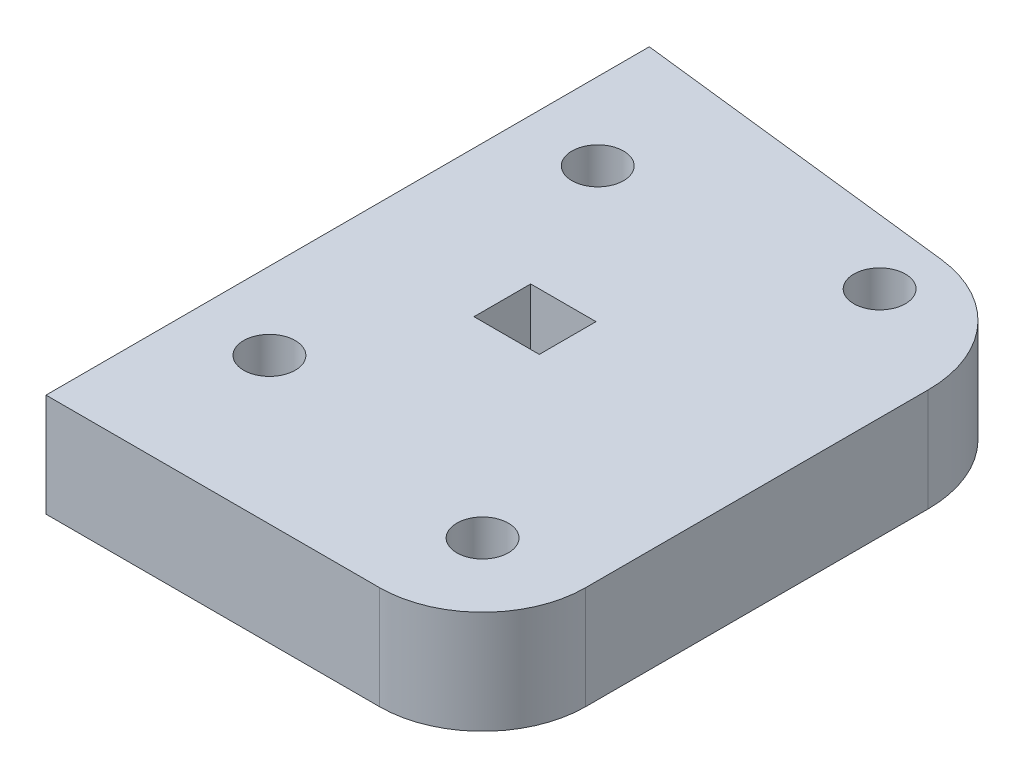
ISO-10303-21;
HEADER;
FILE_DESCRIPTION(('STEP AP214'),'2;1');
FILE_NAME('part.step','',(''),(''),'','','');
FILE_SCHEMA(('AUTOMOTIVE_DESIGN { 1 0 10303 214 1 1 1 1 }'));
ENDSEC;
DATA;
#1=APPLICATION_CONTEXT('core data for automotive mechanical design processes');
#2=APPLICATION_PROTOCOL_DEFINITION('international standard','automotive_design',2000,#1);
#3=PRODUCT_CONTEXT('',#1,'mechanical');
#4=PRODUCT('Part','Part','',(#3));
#5=PRODUCT_RELATED_PRODUCT_CATEGORY('part','',(#4));
#6=PRODUCT_DEFINITION_FORMATION('','',#4);
#7=PRODUCT_DEFINITION_CONTEXT('part definition',#1,'design');
#8=PRODUCT_DEFINITION('design','',#6,#7);
#9=PRODUCT_DEFINITION_SHAPE('','',#8);
#10=(LENGTH_UNIT() NAMED_UNIT(*) SI_UNIT(.MILLI.,.METRE.));
#11=(NAMED_UNIT(*) PLANE_ANGLE_UNIT() SI_UNIT($,.RADIAN.));
#12=(NAMED_UNIT(*) SI_UNIT($,.STERADIAN.) SOLID_ANGLE_UNIT());
#13=UNCERTAINTY_MEASURE_WITH_UNIT(LENGTH_MEASURE(1.E-05),#10,'distance_accuracy_value','');
#14=(GEOMETRIC_REPRESENTATION_CONTEXT(3) GLOBAL_UNCERTAINTY_ASSIGNED_CONTEXT((#13)) GLOBAL_UNIT_ASSIGNED_CONTEXT((#10,
#11,#12)) REPRESENTATION_CONTEXT('',''));
#15=CARTESIAN_POINT('',(0.,0.,0.));
#16=DIRECTION('',(0.,0.,1.));
#17=DIRECTION('',(1.,0.,0.));
#18=AXIS2_PLACEMENT_3D('',#15,#16,#17);
#19=CARTESIAN_POINT('',(0.,3.,0.));
#20=DIRECTION('',(0.,1.,0.));
#21=DIRECTION('',(0.,0.,1.));
#22=AXIS2_PLACEMENT_3D('',#19,#20,#21);
#23=PLANE('',#22);
#24=DIRECTION('',(0.,0.,-1.));
#25=VECTOR('',#24,1.);
#26=CARTESIAN_POINT('',(-4.2,3.,1.15));
#27=LINE('',#26,#25);
#28=CARTESIAN_POINT('',(-4.2,3.,-2.15));
#29=VERTEX_POINT('',#28);
#30=CARTESIAN_POINT('',(-4.2,3.,1.15));
#31=VERTEX_POINT('',#30);
#32=EDGE_CURVE('E202',#29,#31,#27,.F.);
#33=ORIENTED_EDGE('',*,*,#32,.F.);
#34=DIRECTION('',(1.,0.,0.));
#35=VECTOR('',#34,1.);
#36=CARTESIAN_POINT('',(-4.2,3.,-2.15));
#37=LINE('',#36,#35);
#38=CARTESIAN_POINT('',(-0.4,3.,-2.15));
#39=VERTEX_POINT('',#38);
#40=EDGE_CURVE('E165',#39,#29,#37,.F.);
#41=ORIENTED_EDGE('',*,*,#40,.F.);
#42=DIRECTION('',(0.,0.,1.));
#43=VECTOR('',#42,1.);
#44=CARTESIAN_POINT('',(-0.4,3.,-2.15));
#45=LINE('',#44,#43);
#46=CARTESIAN_POINT('',(-0.4,3.,1.15));
#47=VERTEX_POINT('',#46);
#48=EDGE_CURVE('E216',#47,#39,#45,.F.);
#49=ORIENTED_EDGE('',*,*,#48,.F.);
#50=DIRECTION('',(-1.,0.,0.));
#51=VECTOR('',#50,1.);
#52=CARTESIAN_POINT('',(-0.4,3.,1.15));
#53=LINE('',#52,#51);
#54=EDGE_CURVE('E211',#31,#47,#53,.F.);
#55=ORIENTED_EDGE('',*,*,#54,.F.);
#56=EDGE_LOOP('',(#33,#41,#49,#55));
#57=FACE_BOUND('',#56,.T.);
#58=CARTESIAN_POINT('',(-8.2,3.,-10.05));
#59=DIRECTION('',(0.,1.,0.));
#60=DIRECTION('',(0.,0.,1.));
#61=AXIS2_PLACEMENT_3D('',#58,#59,#60);
#62=CIRCLE('',#61,1.5);
#63=CARTESIAN_POINT('',(-8.2,3.,-8.55));
#64=VERTEX_POINT('',#63);
#65=EDGE_CURVE('E162',#64,#64,#62,.F.);
#66=ORIENTED_EDGE('',*,*,#65,.T.);
#67=EDGE_LOOP('',(#66));
#68=FACE_BOUND('',#67,.T.);
#69=CARTESIAN_POINT('',(-8.2,3.,9.05));
#70=DIRECTION('',(0.,1.,0.));
#71=DIRECTION('',(0.,0.,1.));
#72=AXIS2_PLACEMENT_3D('',#69,#70,#71);
#73=CIRCLE('',#72,1.5);
#74=CARTESIAN_POINT('',(-8.2,3.,10.55));
#75=VERTEX_POINT('',#74);
#76=EDGE_CURVE('E166',#75,#75,#73,.F.);
#77=ORIENTED_EDGE('',*,*,#76,.T.);
#78=EDGE_LOOP('',(#77));
#79=FACE_BOUND('',#78,.T.);
#80=CARTESIAN_POINT('',(7.2,3.,12.05));
#81=DIRECTION('',(0.,1.,0.));
#82=DIRECTION('',(0.,0.,1.));
#83=AXIS2_PLACEMENT_3D('',#80,#81,#82);
#84=CIRCLE('',#83,1.5);
#85=CARTESIAN_POINT('',(7.2,3.,13.55));
#86=VERTEX_POINT('',#85);
#87=EDGE_CURVE('E170',#86,#86,#84,.F.);
#88=ORIENTED_EDGE('',*,*,#87,.T.);
#89=EDGE_LOOP('',(#88));
#90=FACE_BOUND('',#89,.T.);
#91=CARTESIAN_POINT('',(6.2,3.,-12.05));
#92=DIRECTION('',(0.,1.,0.));
#93=DIRECTION('',(0.,0.,1.));
#94=AXIS2_PLACEMENT_3D('',#91,#92,#93);
#95=CIRCLE('',#94,1.5);
#96=CARTESIAN_POINT('',(6.2,3.,-10.55));
#97=VERTEX_POINT('',#96);
#98=EDGE_CURVE('E174',#97,#97,#95,.F.);
#99=ORIENTED_EDGE('',*,*,#98,.T.);
#100=EDGE_LOOP('',(#99));
#101=FACE_BOUND('',#100,.T.);
#102=DIRECTION('',(-0.993372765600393,0.,-0.114937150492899));
#103=VECTOR('',#102,1.);
#104=CARTESIAN_POINT('',(6.50456005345,3.,-15.32795658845));
#105=LINE('',#104,#103);
#106=CARTESIAN_POINT('',(-12.7000000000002,3.,-17.5499999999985));
#107=VERTEX_POINT('',#106);
#108=CARTESIAN_POINT('',(6.50456005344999,3.,-15.32795658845));
#109=VERTEX_POINT('',#108);
#110=EDGE_CURVE('E127',#107,#109,#105,.F.);
#111=ORIENTED_EDGE('',*,*,#110,.F.);
#112=DIRECTION('',(0.,0.,1.));
#113=VECTOR('',#112,1.);
#114=CARTESIAN_POINT('',(-12.7,3.,-17.55));
#115=LINE('',#114,#113);
#116=CARTESIAN_POINT('',(-12.7,3.,17.55));
#117=VERTEX_POINT('',#116);
#118=EDGE_CURVE('E110',#117,#107,#115,.F.);
#119=ORIENTED_EDGE('',*,*,#118,.F.);
#120=DIRECTION('',(1.,0.,0.));
#121=VECTOR('',#120,1.);
#122=CARTESIAN_POINT('',(-12.7,3.,17.55));
#123=LINE('',#122,#121);
#124=CARTESIAN_POINT('',(6.7,3.,17.55));
#125=VERTEX_POINT('',#124);
#126=EDGE_CURVE('E108',#125,#117,#123,.F.);
#127=ORIENTED_EDGE('',*,*,#126,.F.);
#128=CARTESIAN_POINT('',(6.7,3.,11.55));
#129=DIRECTION('',(0.,1.,0.));
#130=DIRECTION('',(0.,0.,1.));
#131=AXIS2_PLACEMENT_3D('',#128,#129,#130);
#132=CIRCLE('',#131,6.);
#133=CARTESIAN_POINT('',(12.7,3.,11.55));
#134=VERTEX_POINT('',#133);
#135=EDGE_CURVE('E20',#134,#125,#132,.F.);
#136=ORIENTED_EDGE('',*,*,#135,.F.);
#137=DIRECTION('',(0.,0.,-1.));
#138=VECTOR('',#137,1.);
#139=CARTESIAN_POINT('',(12.7,3.,11.55));
#140=LINE('',#139,#138);
#141=CARTESIAN_POINT('',(12.7,3.,-8.37434722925));
#142=VERTEX_POINT('',#141);
#143=EDGE_CURVE('E93',#142,#134,#140,.F.);
#144=ORIENTED_EDGE('',*,*,#143,.F.);
#145=CARTESIAN_POINT('',(5.7,3.,-8.37434722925));
#146=DIRECTION('',(0.,1.,0.));
#147=DIRECTION('',(0.,0.,1.));
#148=AXIS2_PLACEMENT_3D('',#145,#146,#147);
#149=CIRCLE('',#148,7.);
#150=EDGE_CURVE('E176',#109,#142,#149,.F.);
#151=ORIENTED_EDGE('',*,*,#150,.F.);
#152=EDGE_LOOP('',(#111,#119,#127,#136,#144,#151));
#153=FACE_BOUND('',#152,.T.);
#154=ADVANCED_FACE('F17',(#57,#68,#79,#90,#101,#153),#23,.T.);
#155=CARTESIAN_POINT('',(-12.7,-3.,-17.55));
#156=DIRECTION('',(-1.,0.,0.));
#157=DIRECTION('',(0.,0.,1.));
#158=AXIS2_PLACEMENT_3D('',#155,#156,#157);
#159=PLANE('',#158);
#160=DIRECTION('',(0.,1.,0.));
#161=VECTOR('',#160,1.);
#162=CARTESIAN_POINT('',(-12.7000000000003,-3.,-17.5499999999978));
#163=LINE('',#162,#161);
#164=CARTESIAN_POINT('',(-12.7000000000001,-3.,-17.5499999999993));
#165=VERTEX_POINT('',#164);
#166=EDGE_CURVE('E130',#165,#107,#163,.T.);
#167=ORIENTED_EDGE('',*,*,#166,.F.);
#168=DIRECTION('',(0.,0.,1.));
#169=VECTOR('',#168,1.);
#170=CARTESIAN_POINT('',(-12.7,-3.,0.));
#171=LINE('',#170,#169);
#172=CARTESIAN_POINT('',(-12.7,-3.,17.55));
#173=VERTEX_POINT('',#172);
#174=EDGE_CURVE('E197',#165,#173,#171,.T.);
#175=ORIENTED_EDGE('',*,*,#174,.T.);
#176=DIRECTION('',(0.,1.,0.));
#177=VECTOR('',#176,1.);
#178=CARTESIAN_POINT('',(-12.7,-3.,17.55));
#179=LINE('',#178,#177);
#180=EDGE_CURVE('E106',#117,#173,#179,.F.);
#181=ORIENTED_EDGE('',*,*,#180,.F.);
#182=ORIENTED_EDGE('',*,*,#118,.T.);
#183=EDGE_LOOP('',(#167,#175,#181,#182));
#184=FACE_BOUND('',#183,.T.);
#185=ADVANCED_FACE('F231',(#184),#159,.T.);
#186=CARTESIAN_POINT('',(-12.7,-3.,17.55));
#187=DIRECTION('',(0.,0.,1.));
#188=DIRECTION('',(1.,0.,0.));
#189=AXIS2_PLACEMENT_3D('',#186,#187,#188);
#190=PLANE('',#189);
#191=ORIENTED_EDGE('',*,*,#180,.T.);
#192=DIRECTION('',(1.,0.,0.));
#193=VECTOR('',#192,1.);
#194=CARTESIAN_POINT('',(0.,-3.,17.55));
#195=LINE('',#194,#193);
#196=CARTESIAN_POINT('',(6.7,-3.,17.55));
#197=VERTEX_POINT('',#196);
#198=EDGE_CURVE('E117',#173,#197,#195,.T.);
#199=ORIENTED_EDGE('',*,*,#198,.T.);
#200=DIRECTION('',(0.,1.,0.));
#201=VECTOR('',#200,1.);
#202=CARTESIAN_POINT('',(6.7,-3.,17.55));
#203=LINE('',#202,#201);
#204=EDGE_CURVE('E102',#125,#197,#203,.F.);
#205=ORIENTED_EDGE('',*,*,#204,.F.);
#206=ORIENTED_EDGE('',*,*,#126,.T.);
#207=EDGE_LOOP('',(#191,#199,#205,#206));
#208=FACE_BOUND('',#207,.T.);
#209=ADVANCED_FACE('F115',(#208),#190,.T.);
#210=CARTESIAN_POINT('',(6.7,-3.,11.55));
#211=DIRECTION('',(0.,1.,0.));
#212=DIRECTION('',(0.,0.,1.));
#213=AXIS2_PLACEMENT_3D('',#210,#211,#212);
#214=CYLINDRICAL_SURFACE('',#213,6.);
#215=ORIENTED_EDGE('',*,*,#204,.T.);
#216=CARTESIAN_POINT('',(6.7,-3.,11.55));
#217=DIRECTION('',(0.,1.,0.));
#218=DIRECTION('',(0.,0.,1.));
#219=AXIS2_PLACEMENT_3D('',#216,#217,#218);
#220=CIRCLE('',#219,6.);
#221=CARTESIAN_POINT('',(12.7,-3.,11.55));
#222=VERTEX_POINT('',#221);
#223=EDGE_CURVE('E159',#197,#222,#220,.T.);
#224=ORIENTED_EDGE('',*,*,#223,.T.);
#225=DIRECTION('',(0.,1.,0.));
#226=VECTOR('',#225,1.);
#227=CARTESIAN_POINT('',(12.7,-3.,11.55));
#228=LINE('',#227,#226);
#229=EDGE_CURVE('E104',#134,#222,#228,.F.);
#230=ORIENTED_EDGE('',*,*,#229,.F.);
#231=ORIENTED_EDGE('',*,*,#135,.T.);
#232=EDGE_LOOP('',(#215,#224,#230,#231));
#233=FACE_BOUND('',#232,.T.);
#234=ADVANCED_FACE('F99',(#233),#214,.T.);
#235=CARTESIAN_POINT('',(12.7,-3.,11.55));
#236=DIRECTION('',(1.,0.,0.));
#237=DIRECTION('',(0.,0.,-1.));
#238=AXIS2_PLACEMENT_3D('',#235,#236,#237);
#239=PLANE('',#238);
#240=ORIENTED_EDGE('',*,*,#229,.T.);
#241=DIRECTION('',(0.,0.,1.));
#242=VECTOR('',#241,1.);
#243=CARTESIAN_POINT('',(12.7,-3.,0.));
#244=LINE('',#243,#242);
#245=CARTESIAN_POINT('',(12.7,-3.,-8.37434722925));
#246=VERTEX_POINT('',#245);
#247=EDGE_CURVE('E158',#222,#246,#244,.F.);
#248=ORIENTED_EDGE('',*,*,#247,.T.);
#249=DIRECTION('',(0.,1.,0.));
#250=VECTOR('',#249,1.);
#251=CARTESIAN_POINT('',(12.7,-3.,-8.37434722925));
#252=LINE('',#251,#250);
#253=EDGE_CURVE('E177',#142,#246,#252,.F.);
#254=ORIENTED_EDGE('',*,*,#253,.F.);
#255=ORIENTED_EDGE('',*,*,#143,.T.);
#256=EDGE_LOOP('',(#240,#248,#254,#255));
#257=FACE_BOUND('',#256,.T.);
#258=ADVANCED_FACE('F185',(#257),#239,.T.);
#259=CARTESIAN_POINT('',(5.7,-3.,-8.37434722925));
#260=DIRECTION('',(0.,1.,0.));
#261=DIRECTION('',(0.,0.,1.));
#262=AXIS2_PLACEMENT_3D('',#259,#260,#261);
#263=CYLINDRICAL_SURFACE('',#262,7.);
#264=ORIENTED_EDGE('',*,*,#253,.T.);
#265=CARTESIAN_POINT('',(5.7,-3.,-8.37434722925));
#266=DIRECTION('',(0.,1.,0.));
#267=DIRECTION('',(0.,0.,1.));
#268=AXIS2_PLACEMENT_3D('',#265,#266,#267);
#269=CIRCLE('',#268,7.);
#270=CARTESIAN_POINT('',(6.50456005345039,-3.,-15.32795658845));
#271=VERTEX_POINT('',#270);
#272=EDGE_CURVE('E155',#246,#271,#269,.T.);
#273=ORIENTED_EDGE('',*,*,#272,.T.);
#274=DIRECTION('',(0.,1.,0.));
#275=VECTOR('',#274,1.);
#276=CARTESIAN_POINT('',(6.50456005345,-3.,-15.32795658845));
#277=LINE('',#276,#275);
#278=EDGE_CURVE('E129',#109,#271,#277,.F.);
#279=ORIENTED_EDGE('',*,*,#278,.F.);
#280=ORIENTED_EDGE('',*,*,#150,.T.);
#281=EDGE_LOOP('',(#264,#273,#279,#280));
#282=FACE_BOUND('',#281,.T.);
#283=ADVANCED_FACE('F234',(#282),#263,.T.);
#284=CARTESIAN_POINT('',(6.50456005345,-3.,-15.32795658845));
#285=DIRECTION('',(0.114937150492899,0.,-0.993372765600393));
#286=DIRECTION('',(-0.993372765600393,0.,-0.114937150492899));
#287=AXIS2_PLACEMENT_3D('',#284,#285,#286);
#288=PLANE('',#287);
#289=ORIENTED_EDGE('',*,*,#278,.T.);
#290=DIRECTION('',(-0.993372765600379,0.,-0.114937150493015));
#291=VECTOR('',#290,1.);
#292=CARTESIAN_POINT('',(6.50456005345,-3.,-15.32795658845));
#293=LINE('',#292,#291);
#294=EDGE_CURVE('E154',#271,#165,#293,.T.);
#295=ORIENTED_EDGE('',*,*,#294,.T.);
#296=ORIENTED_EDGE('',*,*,#166,.T.);
#297=ORIENTED_EDGE('',*,*,#110,.T.);
#298=EDGE_LOOP('',(#289,#295,#296,#297));
#299=FACE_BOUND('',#298,.T.);
#300=ADVANCED_FACE('F235',(#299),#288,.T.);
#301=CARTESIAN_POINT('',(6.2,-3.,-12.05));
#302=DIRECTION('',(0.,1.,0.));
#303=DIRECTION('',(0.,0.,1.));
#304=AXIS2_PLACEMENT_3D('',#301,#302,#303);
#305=CYLINDRICAL_SURFACE('',#304,1.5);
#306=ORIENTED_EDGE('',*,*,#98,.F.);
#307=EDGE_LOOP('',(#306));
#308=FACE_BOUND('',#307,.T.);
#309=CARTESIAN_POINT('',(6.2,-3.,-12.05));
#310=DIRECTION('',(0.,1.,0.));
#311=DIRECTION('',(0.,0.,1.));
#312=AXIS2_PLACEMENT_3D('',#309,#310,#311);
#313=CIRCLE('',#312,1.5);
#314=CARTESIAN_POINT('',(6.2,-3.,-10.55));
#315=VERTEX_POINT('',#314);
#316=EDGE_CURVE('E151',#315,#315,#313,.F.);
#317=ORIENTED_EDGE('',*,*,#316,.T.);
#318=EDGE_LOOP('',(#317));
#319=FACE_BOUND('',#318,.T.);
#320=ADVANCED_FACE('F237',(#308,#319),#305,.F.);
#321=CARTESIAN_POINT('',(7.2,-3.,12.05));
#322=DIRECTION('',(0.,1.,0.));
#323=DIRECTION('',(0.,0.,1.));
#324=AXIS2_PLACEMENT_3D('',#321,#322,#323);
#325=CYLINDRICAL_SURFACE('',#324,1.5);
#326=ORIENTED_EDGE('',*,*,#87,.F.);
#327=EDGE_LOOP('',(#326));
#328=FACE_BOUND('',#327,.T.);
#329=CARTESIAN_POINT('',(7.2,-3.,12.05));
#330=DIRECTION('',(0.,1.,0.));
#331=DIRECTION('',(0.,0.,1.));
#332=AXIS2_PLACEMENT_3D('',#329,#330,#331);
#333=CIRCLE('',#332,1.5);
#334=CARTESIAN_POINT('',(7.2,-3.,13.55));
#335=VERTEX_POINT('',#334);
#336=EDGE_CURVE('E147',#335,#335,#333,.F.);
#337=ORIENTED_EDGE('',*,*,#336,.T.);
#338=EDGE_LOOP('',(#337));
#339=FACE_BOUND('',#338,.T.);
#340=ADVANCED_FACE('F244',(#328,#339),#325,.F.);
#341=CARTESIAN_POINT('',(-8.2,-3.,9.05));
#342=DIRECTION('',(0.,1.,0.));
#343=DIRECTION('',(0.,0.,1.));
#344=AXIS2_PLACEMENT_3D('',#341,#342,#343);
#345=CYLINDRICAL_SURFACE('',#344,1.5);
#346=ORIENTED_EDGE('',*,*,#76,.F.);
#347=EDGE_LOOP('',(#346));
#348=FACE_BOUND('',#347,.T.);
#349=CARTESIAN_POINT('',(-8.2,-3.,9.05));
#350=DIRECTION('',(0.,1.,0.));
#351=DIRECTION('',(0.,0.,1.));
#352=AXIS2_PLACEMENT_3D('',#349,#350,#351);
#353=CIRCLE('',#352,1.5);
#354=CARTESIAN_POINT('',(-8.2,-3.,10.55));
#355=VERTEX_POINT('',#354);
#356=EDGE_CURVE('E143',#355,#355,#353,.F.);
#357=ORIENTED_EDGE('',*,*,#356,.T.);
#358=EDGE_LOOP('',(#357));
#359=FACE_BOUND('',#358,.T.);
#360=ADVANCED_FACE('F274',(#348,#359),#345,.F.);
#361=CARTESIAN_POINT('',(-8.2,-3.,-10.05));
#362=DIRECTION('',(0.,1.,0.));
#363=DIRECTION('',(0.,0.,1.));
#364=AXIS2_PLACEMENT_3D('',#361,#362,#363);
#365=CYLINDRICAL_SURFACE('',#364,1.5);
#366=ORIENTED_EDGE('',*,*,#65,.F.);
#367=EDGE_LOOP('',(#366));
#368=FACE_BOUND('',#367,.T.);
#369=CARTESIAN_POINT('',(-8.2,-3.,-10.05));
#370=DIRECTION('',(0.,1.,0.));
#371=DIRECTION('',(0.,0.,1.));
#372=AXIS2_PLACEMENT_3D('',#369,#370,#371);
#373=CIRCLE('',#372,1.5);
#374=CARTESIAN_POINT('',(-8.2,-3.,-8.55));
#375=VERTEX_POINT('',#374);
#376=EDGE_CURVE('E139',#375,#375,#373,.F.);
#377=ORIENTED_EDGE('',*,*,#376,.T.);
#378=EDGE_LOOP('',(#377));
#379=FACE_BOUND('',#378,.T.);
#380=ADVANCED_FACE('F270',(#368,#379),#365,.F.);
#381=CARTESIAN_POINT('',(-4.2,-3.,-2.15));
#382=DIRECTION('',(0.,0.,1.));
#383=DIRECTION('',(1.,0.,0.));
#384=AXIS2_PLACEMENT_3D('',#381,#382,#383);
#385=PLANE('',#384);
#386=DIRECTION('',(0.,1.,0.));
#387=VECTOR('',#386,1.);
#388=CARTESIAN_POINT('',(-4.2,-3.,-2.15));
#389=LINE('',#388,#387);
#390=CARTESIAN_POINT('',(-4.2,-3.,-2.15));
#391=VERTEX_POINT('',#390);
#392=EDGE_CURVE('E205',#391,#29,#389,.T.);
#393=ORIENTED_EDGE('',*,*,#392,.F.);
#394=DIRECTION('',(1.,0.,0.));
#395=VECTOR('',#394,1.);
#396=CARTESIAN_POINT('',(0.,-3.,-2.15));
#397=LINE('',#396,#395);
#398=CARTESIAN_POINT('',(-0.4,-3.,-2.15));
#399=VERTEX_POINT('',#398);
#400=EDGE_CURVE('E142',#391,#399,#397,.T.);
#401=ORIENTED_EDGE('',*,*,#400,.T.);
#402=DIRECTION('',(0.,1.,0.));
#403=VECTOR('',#402,1.);
#404=CARTESIAN_POINT('',(-0.4,-3.,-2.15));
#405=LINE('',#404,#403);
#406=EDGE_CURVE('E214',#39,#399,#405,.F.);
#407=ORIENTED_EDGE('',*,*,#406,.F.);
#408=ORIENTED_EDGE('',*,*,#40,.T.);
#409=EDGE_LOOP('',(#393,#401,#407,#408));
#410=FACE_BOUND('',#409,.T.);
#411=ADVANCED_FACE('F266',(#410),#385,.T.);
#412=CARTESIAN_POINT('',(-0.4,-3.,-2.15));
#413=DIRECTION('',(-1.,0.,0.));
#414=DIRECTION('',(0.,0.,1.));
#415=AXIS2_PLACEMENT_3D('',#412,#413,#414);
#416=PLANE('',#415);
#417=ORIENTED_EDGE('',*,*,#406,.T.);
#418=DIRECTION('',(0.,0.,1.));
#419=VECTOR('',#418,1.);
#420=CARTESIAN_POINT('',(-0.4,-3.,0.));
#421=LINE('',#420,#419);
#422=CARTESIAN_POINT('',(-0.4,-3.,1.15));
#423=VERTEX_POINT('',#422);
#424=EDGE_CURVE('E319',#399,#423,#421,.T.);
#425=ORIENTED_EDGE('',*,*,#424,.T.);
#426=DIRECTION('',(0.,1.,0.));
#427=VECTOR('',#426,1.);
#428=CARTESIAN_POINT('',(-0.4,-3.,1.15));
#429=LINE('',#428,#427);
#430=EDGE_CURVE('E208',#47,#423,#429,.F.);
#431=ORIENTED_EDGE('',*,*,#430,.F.);
#432=ORIENTED_EDGE('',*,*,#48,.T.);
#433=EDGE_LOOP('',(#417,#425,#431,#432));
#434=FACE_BOUND('',#433,.T.);
#435=ADVANCED_FACE('F262',(#434),#416,.T.);
#436=CARTESIAN_POINT('',(-0.4,-3.,1.15));
#437=DIRECTION('',(0.,0.,-1.));
#438=DIRECTION('',(-1.,0.,0.));
#439=AXIS2_PLACEMENT_3D('',#436,#437,#438);
#440=PLANE('',#439);
#441=ORIENTED_EDGE('',*,*,#430,.T.);
#442=DIRECTION('',(1.,0.,0.));
#443=VECTOR('',#442,1.);
#444=CARTESIAN_POINT('',(0.,-3.,1.15));
#445=LINE('',#444,#443);
#446=CARTESIAN_POINT('',(-4.2,-3.,1.15));
#447=VERTEX_POINT('',#446);
#448=EDGE_CURVE('E26',#423,#447,#445,.F.);
#449=ORIENTED_EDGE('',*,*,#448,.T.);
#450=DIRECTION('',(0.,1.,0.));
#451=VECTOR('',#450,1.);
#452=CARTESIAN_POINT('',(-4.2,-3.,1.15));
#453=LINE('',#452,#451);
#454=EDGE_CURVE('E34',#31,#447,#453,.F.);
#455=ORIENTED_EDGE('',*,*,#454,.F.);
#456=ORIENTED_EDGE('',*,*,#54,.T.);
#457=EDGE_LOOP('',(#441,#449,#455,#456));
#458=FACE_BOUND('',#457,.T.);
#459=ADVANCED_FACE('F255',(#458),#440,.T.);
#460=CARTESIAN_POINT('',(-4.2,-3.,1.15));
#461=DIRECTION('',(1.,0.,0.));
#462=DIRECTION('',(0.,0.,-1.));
#463=AXIS2_PLACEMENT_3D('',#460,#461,#462);
#464=PLANE('',#463);
#465=ORIENTED_EDGE('',*,*,#454,.T.);
#466=DIRECTION('',(0.,0.,1.));
#467=VECTOR('',#466,1.);
#468=CARTESIAN_POINT('',(-4.2,-3.,0.));
#469=LINE('',#468,#467);
#470=EDGE_CURVE('E11',#447,#391,#469,.F.);
#471=ORIENTED_EDGE('',*,*,#470,.T.);
#472=ORIENTED_EDGE('',*,*,#392,.T.);
#473=ORIENTED_EDGE('',*,*,#32,.T.);
#474=EDGE_LOOP('',(#465,#471,#472,#473));
#475=FACE_BOUND('',#474,.T.);
#476=ADVANCED_FACE('F249',(#475),#464,.T.);
#477=CARTESIAN_POINT('',(0.,-3.,0.));
#478=DIRECTION('',(0.,1.,0.));
#479=DIRECTION('',(0.,0.,1.));
#480=AXIS2_PLACEMENT_3D('',#477,#478,#479);
#481=PLANE('',#480);
#482=ORIENTED_EDGE('',*,*,#448,.F.);
#483=ORIENTED_EDGE('',*,*,#424,.F.);
#484=ORIENTED_EDGE('',*,*,#400,.F.);
#485=ORIENTED_EDGE('',*,*,#470,.F.);
#486=EDGE_LOOP('',(#482,#483,#484,#485));
#487=FACE_BOUND('',#486,.T.);
#488=ORIENTED_EDGE('',*,*,#376,.F.);
#489=EDGE_LOOP('',(#488));
#490=FACE_BOUND('',#489,.T.);
#491=ORIENTED_EDGE('',*,*,#356,.F.);
#492=EDGE_LOOP('',(#491));
#493=FACE_BOUND('',#492,.T.);
#494=ORIENTED_EDGE('',*,*,#336,.F.);
#495=EDGE_LOOP('',(#494));
#496=FACE_BOUND('',#495,.T.);
#497=ORIENTED_EDGE('',*,*,#316,.F.);
#498=EDGE_LOOP('',(#497));
#499=FACE_BOUND('',#498,.T.);
#500=ORIENTED_EDGE('',*,*,#272,.F.);
#501=ORIENTED_EDGE('',*,*,#247,.F.);
#502=ORIENTED_EDGE('',*,*,#223,.F.);
#503=ORIENTED_EDGE('',*,*,#198,.F.);
#504=ORIENTED_EDGE('',*,*,#174,.F.);
#505=ORIENTED_EDGE('',*,*,#294,.F.);
#506=EDGE_LOOP('',(#500,#501,#502,#503,#504,#505));
#507=FACE_BOUND('',#506,.T.);
#508=ADVANCED_FACE('F188',(#487,#490,#493,#496,#499,#507),#481,.F.);
#509=CLOSED_SHELL('',(#154,#185,#209,#234,#258,#283,#300,#320,#340,#360,#380,#411,#435,#459,
#476,#508));
#510=MANIFOLD_SOLID_BREP('B1',#509);
#511=ADVANCED_BREP_SHAPE_REPRESENTATION('',(#18,#510),#14);
#512=SHAPE_DEFINITION_REPRESENTATION(#9,#511);
ENDSEC;
END-ISO-10303-21;
